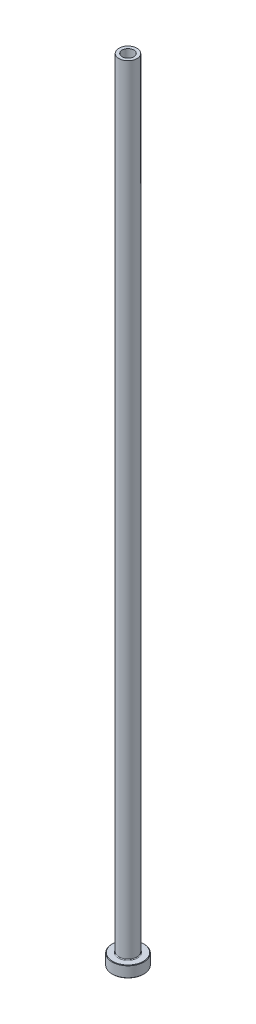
from build123d import *

# Parameters (mm, degrees)
FILLET1_R     = 0.3
CHAMFER1_SIZE = 0.2
CHAMFER3_SIZE = 0.5


with BuildPart() as part:
    # Sketch1 → Revolve1 (revolve)
    with BuildSketch(Plane.XY, mode=Mode.PRIVATE) as revolve1_sk:
        Polygon((-2.6, 350), (-4, 350), (-4, 5), (-7, 5), (-7, 0), (-2.85, 0), (-2.85, 293), (-2.6, 305), align=None)
    revolve(revolve1_sk.sketch.rotate(Axis((0, 92.187680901, 0), (0, -1, 0)), 270), axis=Axis((0, 92.187680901, 0), (0, -1, 0)))

    # Fillet1
    fillet1_edges = [part.edges().sort_by_distance(p)[0] for p in [
        (0, 5, -4),
    ]]
    fillet(fillet1_edges, radius=FILLET1_R)

    # Chamfer1
    chamfer1_edges = [part.edges().sort_by_distance(p)[0] for p in [
        (0, 0, -7),
        (0, 5, -7),
    ]]
    chamfer(chamfer1_edges, length=CHAMFER1_SIZE)

    # Chamfer3
    chamfer3_edges = [part.edges().sort_by_distance(p)[0] for p in [
        (0, 0, -2.85),
    ]]
    chamfer(chamfer3_edges, length=CHAMFER3_SIZE)


solid = part.part
